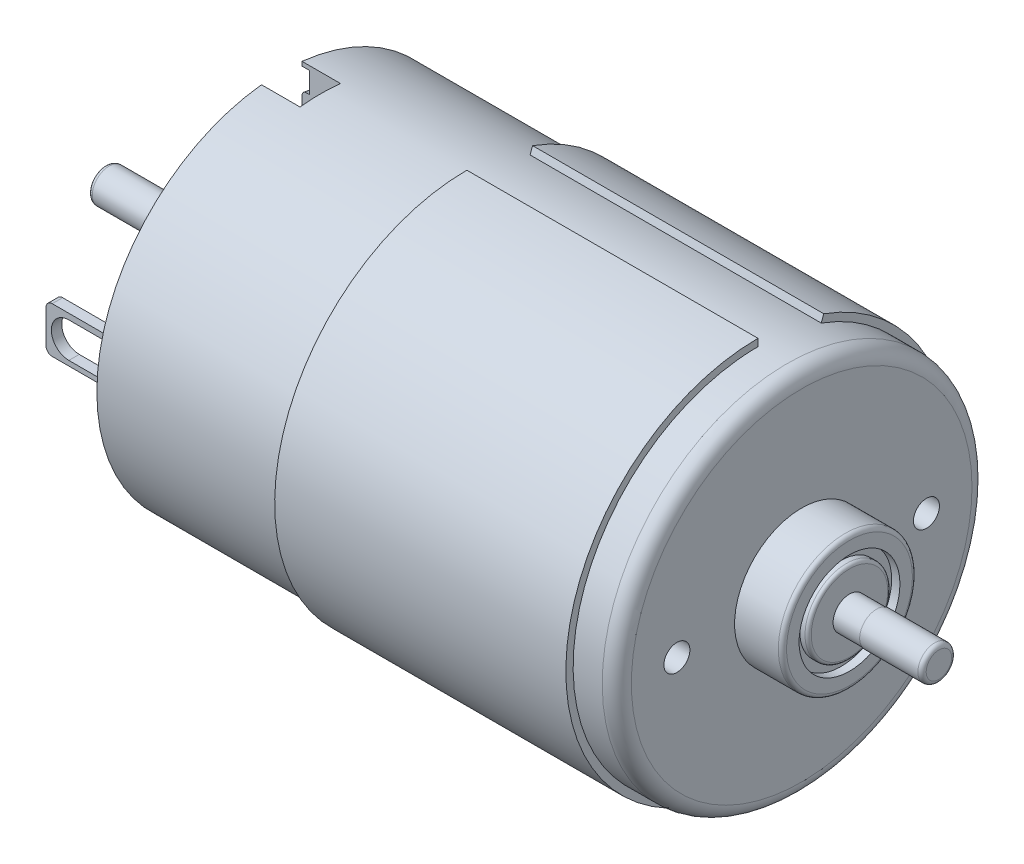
from build123d import *

# Parameters (mm, degrees)
SKETCH1_R       = 17.78
EXTRUDE1_DEPTH  = 50
SKETCH2_R       = 6.45
EXTRUDE2_DEPTH  = 4.6
SKETCH3_R       = 1.58
EXTRUDE3_DEPTH  = 2.6
FILLET1_R       = 1.4
SKETCH4_R       = 6.475
EXTRUDE4_DEPTH  = 3
SKETCH5_R       = 3.95
SKETCH5_R_2     = 2.9
EXTRUDE5_DEPTH  = 1
CHAMFER1_SIZE   = 0.8
EXTRUDE6_START  = 8
SKETCH6_R       = 1.58
EXTRUDE6_DEPTH  = 8
SKETCH7_R       = 4.85
SKETCH7_R_2     = 3.98
EXTRUDE7_DEPTH  = 0.8
FILLET2_R       = 0.3
FILLET3_R       = 0.4
SKETCH8_R       = 17.38
SKETCH8_R_2     = 15.38
EXTRUDE9_DEPTH  = 0.7
FILLET4_R       = 0.4
SKETCH11_W      = 3.9
SKETCH11_H      = 1.342951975
EXTRUDE11_DEPTH = 3.7
EXTRUDE12_START = 0.7
SKETCH13_W      = 5.1
SKETCH13_H      = 11.94
SKETCH13_W_2    = 3.6
SKETCH13_H_2    = 10
EXTRUDE12_DEPTH = 0.7
SKETCH14_W      = 1
SKETCH14_H      = 4.4
EXTRUDE13_DEPTH = 8.6
FILLET5_R       = 0.6
SKETCH17_R      = 1.25
EXTRUDE16_DEPTH = 5.8
SKETCH18_R      = 1.625
EXTRUDE17_DEPTH = 6
EXTRUDE18_START = 6
SKETCH19_R      = 1.625
EXTRUDE18_DEPTH = 6
FILLET6_R       = 0.4
FILLET7_R       = 0.4
SKETCH21_W      = 28
SKETCH21_H      = 0.7
REVOLVE1_ANGLE  = 340
EXTRUDE20_DEPTH = 1
EXTRUDE21_DEPTH = 1


with BuildPart() as part:
    # Sketch1 → Extrude1 (new body)
    with BuildSketch(Plane(origin=(0, 0, 0), x_dir=(0, 0, -1), z_dir=(1, 0, 0))):
        Circle(SKETCH1_R)
    extrude(amount=EXTRUDE1_DEPTH)

    # Sketch2 → Extrude2 (add)
    with BuildSketch(Plane(origin=(50, 0, 0), x_dir=(0, 0, -1), z_dir=(1, 0, 0))):
        Circle(SKETCH2_R)
    extrude(amount=EXTRUDE2_DEPTH)

    # Sketch3 → Extrude3 (add)
    with BuildSketch(Plane(origin=(54.6, 0, 0), x_dir=(0, 0, -1), z_dir=(1, 0, 0))):
        Circle(SKETCH3_R)
    extrude(amount=EXTRUDE3_DEPTH)

    # Fillet1
    fillet1_edges = [part.edges().sort_by_distance(p)[0] for p in [
        (50, 0, 17.78),
    ]]
    fillet(fillet1_edges, radius=FILLET1_R)

    # Sketch4 → Extrude4 (add)
    with BuildSketch(Plane.ZY):
        with Locations(Location((0, 0, 0), (0, 0, 180))):
            Circle(SKETCH4_R)
    extrude(amount=EXTRUDE4_DEPTH)

    # Sketch5 → Extrude5 (add)
    with BuildSketch(Plane.ZY.offset(3)):
        Circle(SKETCH5_R)
        Circle(SKETCH5_R_2, mode=Mode.SUBTRACT)
    extrude(amount=EXTRUDE5_DEPTH)

    # Chamfer1
    chamfer1_edges = [part.edges().sort_by_distance(p)[0] for p in [
        (-4, 0, -3.95),
    ]]
    chamfer(chamfer1_edges, length=CHAMFER1_SIZE)

    # Sketch6 → Extrude6 (add)
    with BuildSketch(Plane.ZY.offset(3).offset(EXTRUDE6_START)):
        with Locations(Location((0, 0, 0), (0, 0, 180))):
            Circle(SKETCH6_R)
    extrude(amount=-EXTRUDE6_DEPTH)

    # Sketch7 → Extrude7 (cut)
    with BuildSketch(Plane(origin=(54.6, 0, 0), x_dir=(0, 0, -1), z_dir=(1, 0, 0))):
        Circle(SKETCH7_R)
        Circle(SKETCH7_R_2, mode=Mode.SUBTRACT)
    extrude(amount=-EXTRUDE7_DEPTH, mode=Mode.SUBTRACT)

    # Fillet2
    fillet2_edges = [part.edges().sort_by_distance(p)[0] for p in [
        (54.6, 0, 3.98),
    ]]
    fillet(fillet2_edges, radius=FILLET2_R)

    # Fillet3
    fillet3_edges = [part.edges().sort_by_distance(p)[0] for p in [
        (54.6, 0, 6.45),
    ]]
    fillet(fillet3_edges, radius=FILLET3_R)

    # Sketch8 → Extrude9 (cut)
    # profile 1 of 3: a face of its own
    with BuildSketch(Plane.ZY):
        Circle(SKETCH8_R)
        Circle(SKETCH8_R_2, mode=Mode.SUBTRACT)
    # profile 2 of 3: a face of its own
    with BuildSketch(Plane.ZY):
        with BuildLine():
            ThreePointArc((-8.971966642, 12.491925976), (-15.38, 0), (-8.971966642, -12.491925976))
            Line((-8.971966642, -12.491925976), (-8.971966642, 12.491925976))
        make_face()
    # profile 3 of 3: a face of its own
    with BuildSketch(Plane.ZY):
        with BuildLine():
            Line((8.971966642, 12.491925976), (8.971966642, -12.491925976))
            ThreePointArc((8.971966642, -12.491925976), (13.684539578, -7.01981314), (15.38, 0))
            ThreePointArc((15.38, 0), (13.684539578, 7.01981314), (8.971966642, 12.491925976))
        make_face()
    extrude(amount=-EXTRUDE9_DEPTH, mode=Mode.SUBTRACT)

    # Fillet4
    fillet4_edges = [part.edges().sort_by_distance(p)[0] for p in [
        (0, 0, 6.475),
        (0, -15.38, 0),
        (0, 0, 8.971966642),
        (0, 15.38, 0),
        (0, 0, -8.971966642),
    ]]
    fillet(fillet4_edges, radius=FILLET4_R)

    # Sketch11 → Extrude11 (cut)
    with BuildSketch(Plane.ZY):
        with BuildLine():
            Line((-1.95, 18.862321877), (-1.95, 14.852538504))
            ThreePointArc((-1.95, 14.852538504), (0, 14.98), (1.95, 14.852538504))
            Line((1.95, 14.852538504), (1.95, 18.862321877))
            Line((1.95, 18.862321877), (-1.95, 18.862321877))
        make_face()
        with BuildLine():
            ThreePointArc((1.95, 14.852538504), (0, 14.98), (-1.95, 14.852538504))
            Line((-1.95, 14.852538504), (-1.95, 13.740074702))
            Line((-1.95, 13.740074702), (1.95, 13.740074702))
            Line((1.95, 13.740074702), (1.95, 14.852538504))
        make_face()
        with BuildLine():
            Line((-1.95, -14.852538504), (-1.95, -17.519369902))
            Line((-1.95, -17.519369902), (1.95, -17.519369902))
            Line((1.95, -17.519369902), (1.95, -14.852538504))
            ThreePointArc((1.95, -14.852538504), (0, -14.98), (-1.95, -14.852538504))
        make_face()
        with BuildLine():
            Line((-1.95, -13.740074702), (-1.95, -14.852538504))
            ThreePointArc((-1.95, -14.852538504), (0, -14.98), (1.95, -14.852538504))
            Line((1.95, -14.852538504), (1.95, -13.740074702))
            Line((1.95, -13.740074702), (-1.95, -13.740074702))
        make_face()
        with Locations((0, -18.19084589)):
            Rectangle(SKETCH11_W, SKETCH11_H)
    extrude(amount=-EXTRUDE11_DEPTH, mode=Mode.SUBTRACT)

    # Sketch13 → Extrude12 (add)
    # profile 1 of 4: a face of its own
    with BuildSketch(Plane.ZY.offset(-0.7).offset(EXTRUDE12_START)):
        with BuildLine():
            Line((16.322484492, 5.97), (16.322484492, -5.97))
            ThreePointArc((16.322484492, -5.97), (17.113579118, -3.031469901), (17.38, 0))
            ThreePointArc((17.38, 0), (17.113579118, 3.031469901), (16.322484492, 5.97))
        make_face()
    # profile 2 of 4: a face of its own
    with BuildSketch(Plane.ZY.offset(-0.7).offset(EXTRUDE12_START)):
        with Locations((13.772484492, 0)):
            Rectangle(SKETCH13_W, SKETCH13_H)
        with Locations((13.772484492, 0)):
            Rectangle(SKETCH13_W_2, SKETCH13_H_2, mode=Mode.SUBTRACT)
    # profile 3 of 4: a face of its own
    with BuildSketch(Plane.ZY.offset(-0.7).offset(EXTRUDE12_START)):
        with Locations((-13.772484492, 0)):
            Rectangle(SKETCH13_W, SKETCH13_H)
        with Locations((-13.772484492, 0)):
            Rectangle(SKETCH13_W_2, SKETCH13_H_2, mode=Mode.SUBTRACT)
    # profile 4 of 4: a face of its own
    with BuildSketch(Plane.ZY.offset(-0.7).offset(EXTRUDE12_START)):
        with BuildLine():
            ThreePointArc((-17.38, 0), (-17.113579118, -3.031469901), (-16.322484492, -5.97))
            Line((-16.322484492, -5.97), (-16.322484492, 5.97))
            ThreePointArc((-16.322484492, 5.97), (-17.113579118, 3.031469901), (-17.38, 0))
        make_face()
    extrude(amount=-EXTRUDE12_DEPTH)

    # Sketch14 → Extrude13 (add)
    with BuildSketch(Plane.ZY.offset(-0.7)):
        with Locations((14.272484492, 0)):
            Rectangle(SKETCH14_W, SKETCH14_H)
        with Locations((-14.272484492, 0)):
            Rectangle(SKETCH14_W, SKETCH14_H)
    extrude(amount=EXTRUDE13_DEPTH)

    # Fillet5
    fillet5_edges = [part.edges().sort_by_distance(p)[0] for p in [
        (-7.9, 2.2, 14.272484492),
        (-7.9, -2.2, 14.272484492),
        (-7.9, 2.2, -14.272484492),
        (-7.9, -2.2, -14.272484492),
    ]]
    fillet(fillet5_edges, radius=FILLET5_R)

    # Sketch17 → Extrude16 (cut)
    with BuildSketch(Plane(origin=(50, 0, 0), x_dir=(0, 0, -1), z_dir=(1, 0, 0))):
        with Locations((12, 0)):
            Circle(SKETCH17_R)
        with Locations(Location((-12, 0, 0), (0, 0, 180))):
            Circle(SKETCH17_R)
    extrude(amount=-EXTRUDE16_DEPTH, mode=Mode.SUBTRACT)

    # Sketch18 → Extrude17 (add)
    with BuildSketch(Plane.ZY.offset(11)):
        Circle(SKETCH18_R)
    extrude(amount=EXTRUDE17_DEPTH)

    # Sketch19 → Extrude18 (add)
    with BuildSketch(Plane(origin=(57.2, 0, 0), x_dir=(0, 0, -1), z_dir=(1, 0, 0)).offset(EXTRUDE18_START)):
        with Locations(Location((0, 0, 0), (0, 0, 180))):
            Circle(SKETCH19_R)
    extrude(amount=-EXTRUDE18_DEPTH)

    # Fillet6
    fillet6_edges = [part.edges().sort_by_distance(p)[0] for p in [
        (63.2, 0, -1.625),
    ]]
    fillet(fillet6_edges, radius=FILLET6_R)

    # Fillet7
    fillet7_edges = [part.edges().sort_by_distance(p)[0] for p in [
        (-17, 0, -1.625),
    ]]
    fillet(fillet7_edges, radius=FILLET7_R)

    # Sketch21 → Revolve1 (revolve)
    with BuildSketch(Plane.XY):
        with Locations((31.8, 18.13)):
            Rectangle(SKETCH21_W, SKETCH21_H)
    revolve(axis=Axis((-19.330744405, 0, 0), (1, 0, 0)), revolution_arc=REVOLVE1_ANGLE)

    # Sketch15 → Extrude20 (cut)
    with BuildSketch(Plane(origin=(0, 0, -14.772484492), x_dir=(-1, 0, 0), z_dir=(0, 0, -1))):
        with BuildLine():
            Line((5.7, -1.684642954), (2.7, -1.684642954))
            ThreePointArc((2.7, -1.684642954), (1.015357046, 0), (2.7, 1.684642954))
            Line((2.7, 1.684642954), (5.7, 1.684642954))
            ThreePointArc((5.7, 1.684642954), (7.384642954, 0), (5.7, -1.684642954))
        make_face()
    extrude(amount=-EXTRUDE20_DEPTH, mode=Mode.SUBTRACT)

    # Sketch22 → Extrude21 (cut)
    with BuildSketch(Plane.XY.offset(14.772484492)):
        with BuildLine():
            Line((-2.7, -1.724787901), (-5.7, -1.724787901))
            ThreePointArc((-5.7, -1.724787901), (-7.384642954, -0.040144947), (-5.7, 1.644498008))
            Line((-5.7, 1.644498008), (-2.7, 1.644498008))
            ThreePointArc((-2.7, 1.644498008), (-1.015357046, -0.040144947), (-2.7, -1.724787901))
        make_face()
    extrude(amount=-EXTRUDE21_DEPTH, mode=Mode.SUBTRACT)


solid = part.part
